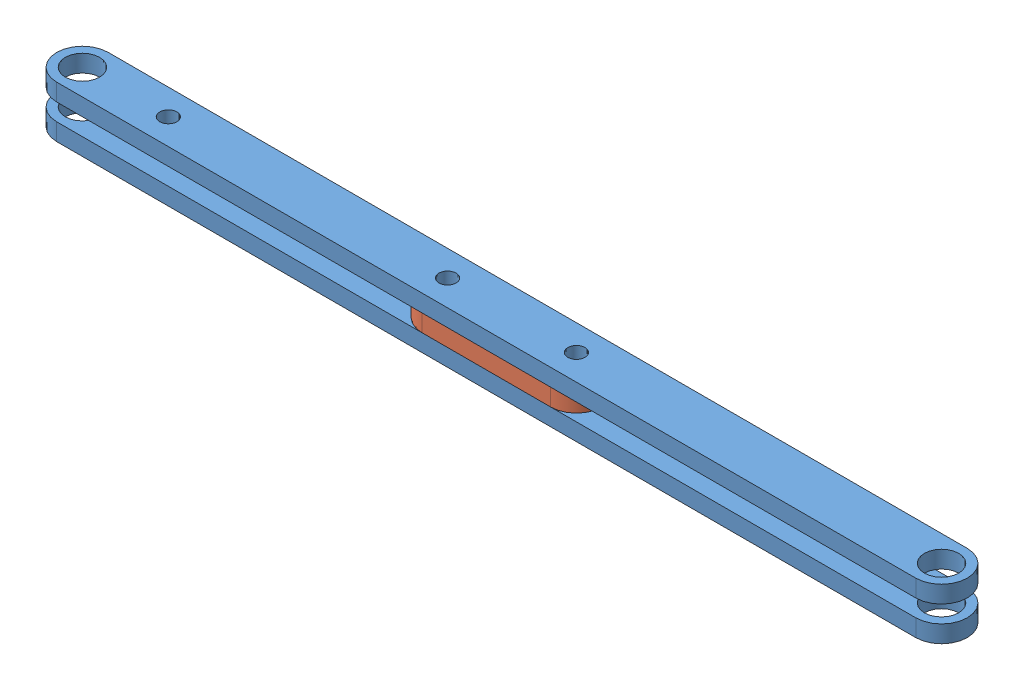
SolidWorks assembly Assem1.sldasm, configuration Default (file format 3400). Lengths in mm.
Overall size (106 6 6).
3 component instances, 2 part files, 6 mates.
Components (placement in the parent):
- Gripper2 link-1: Gripper2 link.SLDPRT [Default] at (-6.8488 2.4243 1.2876) size (106 2 6)
- Gripper2 link-2: Gripper2 link.SLDPRT [Default] at (-6.8488 6.4243 1.2876) size (106 2 6)
- Gripper spacer-1: Gripper spacer.SLDPRT [Default] at (-6.8488 4.4243 1.2876) size (21 2 6)
Mates (geometry in assembly coordinates):
- Coincident1: coincident anti-aligned: plane of ?; plane of ?
- Concentric1: concentric aligned: cylinder of ?; cylinder of ?
- Coincident2: coincident aligned: plane of ?; plane of ?
- Coincident3: coincident anti-aligned: plane of ?; plane of ?
- Concentric2: concentric aligned: cylinder of ?; cylinder of ?
- Coincident4: coincident aligned: plane of ?; plane of ?
